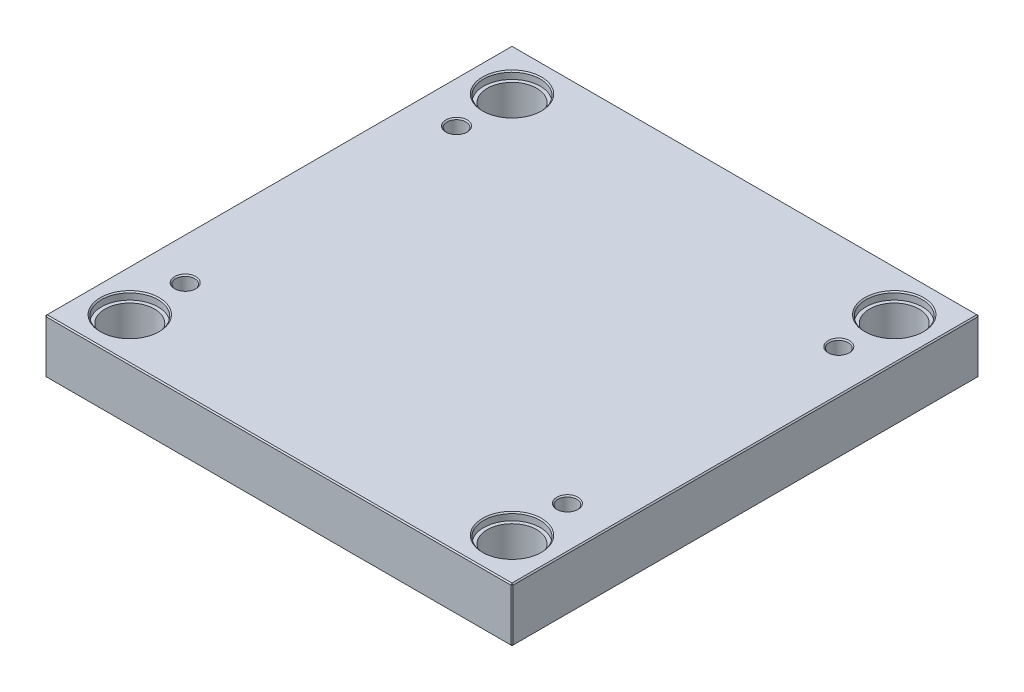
ISO-10303-21;
HEADER;
FILE_DESCRIPTION(('STEP AP214'),'2;1');
FILE_NAME('part.step','',(''),(''),'','','');
FILE_SCHEMA(('AUTOMOTIVE_DESIGN { 1 0 10303 214 1 1 1 1 }'));
ENDSEC;
DATA;
#1=APPLICATION_CONTEXT('core data for automotive mechanical design processes');
#2=APPLICATION_PROTOCOL_DEFINITION('international standard','automotive_design',2000,#1);
#3=PRODUCT_CONTEXT('',#1,'mechanical');
#4=PRODUCT('Part','Part','',(#3));
#5=PRODUCT_RELATED_PRODUCT_CATEGORY('part','',(#4));
#6=PRODUCT_DEFINITION_FORMATION('','',#4);
#7=PRODUCT_DEFINITION_CONTEXT('part definition',#1,'design');
#8=PRODUCT_DEFINITION('design','',#6,#7);
#9=PRODUCT_DEFINITION_SHAPE('','',#8);
#10=(LENGTH_UNIT() NAMED_UNIT(*) SI_UNIT(.MILLI.,.METRE.));
#11=(NAMED_UNIT(*) PLANE_ANGLE_UNIT() SI_UNIT($,.RADIAN.));
#12=(NAMED_UNIT(*) SI_UNIT($,.STERADIAN.) SOLID_ANGLE_UNIT());
#13=UNCERTAINTY_MEASURE_WITH_UNIT(LENGTH_MEASURE(1.E-05),#10,'distance_accuracy_value','');
#14=(GEOMETRIC_REPRESENTATION_CONTEXT(3) GLOBAL_UNCERTAINTY_ASSIGNED_CONTEXT((#13)) GLOBAL_UNIT_ASSIGNED_CONTEXT((#10,
#11,#12)) REPRESENTATION_CONTEXT('',''));
#15=CARTESIAN_POINT('',(0.,0.,0.));
#16=DIRECTION('',(0.,0.,1.));
#17=DIRECTION('',(1.,0.,0.));
#18=AXIS2_PLACEMENT_3D('',#15,#16,#17);
#19=CARTESIAN_POINT('',(-162.,0.,-162.));
#20=DIRECTION('',(0.,1.,0.));
#21=DIRECTION('',(0.,0.,1.));
#22=AXIS2_PLACEMENT_3D('',#19,#20,#21);
#23=CYLINDRICAL_SURFACE('',#22,21.);
#24=CARTESIAN_POINT('',(-162.,1.00000000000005,-162.));
#25=DIRECTION('',(0.,1.,0.));
#26=DIRECTION('',(0.,0.,1.));
#27=AXIS2_PLACEMENT_3D('',#24,#25,#26);
#28=CIRCLE('',#27,21.);
#29=CARTESIAN_POINT('',(-162.,1.00000000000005,-141.));
#30=VERTEX_POINT('',#29);
#31=EDGE_CURVE('E472',#30,#30,#28,.F.);
#32=ORIENTED_EDGE('',*,*,#31,.T.);
#33=EDGE_LOOP('',(#32));
#34=FACE_BOUND('',#33,.T.);
#35=CARTESIAN_POINT('',(-162.,39.7,-162.));
#36=DIRECTION('',(0.,1.,0.));
#37=DIRECTION('',(0.,0.,1.));
#38=AXIS2_PLACEMENT_3D('',#35,#36,#37);
#39=CIRCLE('',#38,21.);
#40=CARTESIAN_POINT('',(-162.,39.7,-141.));
#41=VERTEX_POINT('',#40);
#42=EDGE_CURVE('E221',#41,#41,#39,.F.);
#43=ORIENTED_EDGE('',*,*,#42,.F.);
#44=EDGE_LOOP('',(#43));
#45=FACE_BOUND('',#44,.T.);
#46=ADVANCED_FACE('F16',(#34,#45),#23,.F.);
#47=CARTESIAN_POINT('',(162.,0.,-162.));
#48=DIRECTION('',(0.,1.,0.));
#49=DIRECTION('',(0.,0.,1.));
#50=AXIS2_PLACEMENT_3D('',#47,#48,#49);
#51=CYLINDRICAL_SURFACE('',#50,21.);
#52=CARTESIAN_POINT('',(162.,1.00000000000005,-162.));
#53=DIRECTION('',(0.,1.,0.));
#54=DIRECTION('',(0.,0.,1.));
#55=AXIS2_PLACEMENT_3D('',#52,#53,#54);
#56=CIRCLE('',#55,21.);
#57=CARTESIAN_POINT('',(162.,1.00000000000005,-141.));
#58=VERTEX_POINT('',#57);
#59=EDGE_CURVE('E474',#58,#58,#56,.F.);
#60=ORIENTED_EDGE('',*,*,#59,.T.);
#61=EDGE_LOOP('',(#60));
#62=FACE_BOUND('',#61,.T.);
#63=CARTESIAN_POINT('',(162.,39.7,-162.));
#64=DIRECTION('',(0.,1.,0.));
#65=DIRECTION('',(0.,0.,1.));
#66=AXIS2_PLACEMENT_3D('',#63,#64,#65);
#67=CIRCLE('',#66,21.);
#68=CARTESIAN_POINT('',(162.,39.7,-141.));
#69=VERTEX_POINT('',#68);
#70=EDGE_CURVE('E218',#69,#69,#67,.F.);
#71=ORIENTED_EDGE('',*,*,#70,.F.);
#72=EDGE_LOOP('',(#71));
#73=FACE_BOUND('',#72,.T.);
#74=ADVANCED_FACE('F263',(#62,#73),#51,.F.);
#75=CARTESIAN_POINT('',(162.,0.,162.));
#76=DIRECTION('',(0.,1.,0.));
#77=DIRECTION('',(0.,0.,1.));
#78=AXIS2_PLACEMENT_3D('',#75,#76,#77);
#79=CYLINDRICAL_SURFACE('',#78,21.);
#80=CARTESIAN_POINT('',(162.,1.00000000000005,162.));
#81=DIRECTION('',(0.,1.,0.));
#82=DIRECTION('',(0.,0.,1.));
#83=AXIS2_PLACEMENT_3D('',#80,#81,#82);
#84=CIRCLE('',#83,21.);
#85=CARTESIAN_POINT('',(162.,1.00000000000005,183.));
#86=VERTEX_POINT('',#85);
#87=EDGE_CURVE('E477',#86,#86,#84,.F.);
#88=ORIENTED_EDGE('',*,*,#87,.T.);
#89=EDGE_LOOP('',(#88));
#90=FACE_BOUND('',#89,.T.);
#91=CARTESIAN_POINT('',(162.,39.7,162.));
#92=DIRECTION('',(0.,1.,0.));
#93=DIRECTION('',(0.,0.,1.));
#94=AXIS2_PLACEMENT_3D('',#91,#92,#93);
#95=CIRCLE('',#94,21.);
#96=CARTESIAN_POINT('',(162.,39.7,183.));
#97=VERTEX_POINT('',#96);
#98=EDGE_CURVE('E214',#97,#97,#95,.F.);
#99=ORIENTED_EDGE('',*,*,#98,.F.);
#100=EDGE_LOOP('',(#99));
#101=FACE_BOUND('',#100,.T.);
#102=ADVANCED_FACE('F270',(#90,#101),#79,.F.);
#103=CARTESIAN_POINT('',(-162.,0.,162.));
#104=DIRECTION('',(0.,1.,0.));
#105=DIRECTION('',(0.,0.,1.));
#106=AXIS2_PLACEMENT_3D('',#103,#104,#105);
#107=CYLINDRICAL_SURFACE('',#106,21.);
#108=CARTESIAN_POINT('',(-162.,1.00000000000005,162.));
#109=DIRECTION('',(0.,1.,0.));
#110=DIRECTION('',(0.,0.,1.));
#111=AXIS2_PLACEMENT_3D('',#108,#109,#110);
#112=CIRCLE('',#111,21.);
#113=CARTESIAN_POINT('',(-162.,1.00000000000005,183.));
#114=VERTEX_POINT('',#113);
#115=EDGE_CURVE('E480',#114,#114,#112,.F.);
#116=ORIENTED_EDGE('',*,*,#115,.T.);
#117=EDGE_LOOP('',(#116));
#118=FACE_BOUND('',#117,.T.);
#119=CARTESIAN_POINT('',(-162.,39.7,162.));
#120=DIRECTION('',(0.,1.,0.));
#121=DIRECTION('',(0.,0.,1.));
#122=AXIS2_PLACEMENT_3D('',#119,#120,#121);
#123=CIRCLE('',#122,21.);
#124=CARTESIAN_POINT('',(-162.,39.7,183.));
#125=VERTEX_POINT('',#124);
#126=EDGE_CURVE('E211',#125,#125,#123,.F.);
#127=ORIENTED_EDGE('',*,*,#126,.F.);
#128=EDGE_LOOP('',(#127));
#129=FACE_BOUND('',#128,.T.);
#130=ADVANCED_FACE('F277',(#118,#129),#107,.F.);
#131=CARTESIAN_POINT('',(-198.,46.,198.));
#132=DIRECTION('',(1.,0.,0.));
#133=DIRECTION('',(0.,0.,-1.));
#134=AXIS2_PLACEMENT_3D('',#131,#132,#133);
#135=PLANE('',#134);
#136=DIRECTION('',(0.,-1.,0.));
#137=VECTOR('',#136,1.);
#138=CARTESIAN_POINT('',(-198.,46.,-197.));
#139=LINE('',#138,#137);
#140=CARTESIAN_POINT('',(-198.,45.,-197.));
#141=VERTEX_POINT('',#140);
#142=CARTESIAN_POINT('',(-198.,1.,-197.));
#143=VERTEX_POINT('',#142);
#144=EDGE_CURVE('E487',#141,#143,#139,.T.);
#145=ORIENTED_EDGE('',*,*,#144,.T.);
#146=DIRECTION('',(0.,0.,1.));
#147=VECTOR('',#146,1.);
#148=CARTESIAN_POINT('',(-198.,1.,198.));
#149=LINE('',#148,#147);
#150=CARTESIAN_POINT('',(-198.,1.,197.));
#151=VERTEX_POINT('',#150);
#152=EDGE_CURVE('E490',#143,#151,#149,.T.);
#153=ORIENTED_EDGE('',*,*,#152,.T.);
#154=DIRECTION('',(0.,1.,0.));
#155=VECTOR('',#154,1.);
#156=CARTESIAN_POINT('',(-198.,46.,197.));
#157=LINE('',#156,#155);
#158=CARTESIAN_POINT('',(-198.,45.,197.));
#159=VERTEX_POINT('',#158);
#160=EDGE_CURVE('E485',#151,#159,#157,.T.);
#161=ORIENTED_EDGE('',*,*,#160,.T.);
#162=DIRECTION('',(0.,0.,-1.));
#163=VECTOR('',#162,1.);
#164=CARTESIAN_POINT('',(-198.,45.,-198.));
#165=LINE('',#164,#163);
#166=EDGE_CURVE('E483',#159,#141,#165,.T.);
#167=ORIENTED_EDGE('',*,*,#166,.T.);
#168=EDGE_LOOP('',(#145,#153,#161,#167));
#169=FACE_BOUND('',#168,.T.);
#170=ADVANCED_FACE('F298',(#169),#135,.F.);
#171=CARTESIAN_POINT('',(198.,46.,198.));
#172=DIRECTION('',(0.,0.,-1.));
#173=DIRECTION('',(-1.,0.,0.));
#174=AXIS2_PLACEMENT_3D('',#171,#172,#173);
#175=PLANE('',#174);
#176=DIRECTION('',(-1.,0.,0.));
#177=VECTOR('',#176,1.);
#178=CARTESIAN_POINT('',(-198.,45.,198.));
#179=LINE('',#178,#177);
#180=CARTESIAN_POINT('',(197.,45.,198.));
#181=VERTEX_POINT('',#180);
#182=CARTESIAN_POINT('',(-197.,45.,198.));
#183=VERTEX_POINT('',#182);
#184=EDGE_CURVE('E509',#181,#183,#179,.T.);
#185=ORIENTED_EDGE('',*,*,#184,.T.);
#186=DIRECTION('',(0.,-1.,0.));
#187=VECTOR('',#186,1.);
#188=CARTESIAN_POINT('',(-197.,46.,198.));
#189=LINE('',#188,#187);
#190=CARTESIAN_POINT('',(-197.,1.00000000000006,198.));
#191=VERTEX_POINT('',#190);
#192=EDGE_CURVE('E515',#183,#191,#189,.T.);
#193=ORIENTED_EDGE('',*,*,#192,.T.);
#194=DIRECTION('',(1.,0.,0.));
#195=VECTOR('',#194,1.);
#196=CARTESIAN_POINT('',(198.,1.00000000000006,198.));
#197=LINE('',#196,#195);
#198=CARTESIAN_POINT('',(197.,1.00000000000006,198.));
#199=VERTEX_POINT('',#198);
#200=EDGE_CURVE('E513',#191,#199,#197,.T.);
#201=ORIENTED_EDGE('',*,*,#200,.T.);
#202=DIRECTION('',(0.,1.,0.));
#203=VECTOR('',#202,1.);
#204=CARTESIAN_POINT('',(197.,46.,198.));
#205=LINE('',#204,#203);
#206=EDGE_CURVE('E511',#199,#181,#205,.T.);
#207=ORIENTED_EDGE('',*,*,#206,.T.);
#208=EDGE_LOOP('',(#185,#193,#201,#207));
#209=FACE_BOUND('',#208,.T.);
#210=ADVANCED_FACE('F294',(#209),#175,.F.);
#211=CARTESIAN_POINT('',(198.,46.,198.));
#212=DIRECTION('',(-1.,0.,0.));
#213=DIRECTION('',(0.,0.,1.));
#214=AXIS2_PLACEMENT_3D('',#211,#212,#213);
#215=PLANE('',#214);
#216=DIRECTION('',(0.,0.,-1.));
#217=VECTOR('',#216,1.);
#218=CARTESIAN_POINT('',(198.,1.00000000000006,198.));
#219=LINE('',#218,#217);
#220=CARTESIAN_POINT('',(198.,1.00000000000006,197.));
#221=VERTEX_POINT('',#220);
#222=CARTESIAN_POINT('',(198.,1.00000000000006,-197.));
#223=VERTEX_POINT('',#222);
#224=EDGE_CURVE('E504',#221,#223,#219,.T.);
#225=ORIENTED_EDGE('',*,*,#224,.T.);
#226=DIRECTION('',(0.,1.,0.));
#227=VECTOR('',#226,1.);
#228=CARTESIAN_POINT('',(198.,46.,-197.));
#229=LINE('',#228,#227);
#230=CARTESIAN_POINT('',(198.,45.,-197.));
#231=VERTEX_POINT('',#230);
#232=EDGE_CURVE('E506',#223,#231,#229,.T.);
#233=ORIENTED_EDGE('',*,*,#232,.T.);
#234=DIRECTION('',(0.,0.,1.));
#235=VECTOR('',#234,1.);
#236=CARTESIAN_POINT('',(198.,45.,198.));
#237=LINE('',#236,#235);
#238=CARTESIAN_POINT('',(198.,45.,197.));
#239=VERTEX_POINT('',#238);
#240=EDGE_CURVE('E500',#231,#239,#237,.T.);
#241=ORIENTED_EDGE('',*,*,#240,.T.);
#242=DIRECTION('',(0.,-1.,0.));
#243=VECTOR('',#242,1.);
#244=CARTESIAN_POINT('',(198.,46.,197.));
#245=LINE('',#244,#243);
#246=EDGE_CURVE('E502',#239,#221,#245,.T.);
#247=ORIENTED_EDGE('',*,*,#246,.T.);
#248=EDGE_LOOP('',(#225,#233,#241,#247));
#249=FACE_BOUND('',#248,.T.);
#250=ADVANCED_FACE('F290',(#249),#215,.F.);
#251=CARTESIAN_POINT('',(198.,46.,-198.));
#252=DIRECTION('',(0.,0.,1.));
#253=DIRECTION('',(1.,0.,0.));
#254=AXIS2_PLACEMENT_3D('',#251,#252,#253);
#255=PLANE('',#254);
#256=DIRECTION('',(0.,-1.,0.));
#257=VECTOR('',#256,1.);
#258=CARTESIAN_POINT('',(197.,46.,-198.));
#259=LINE('',#258,#257);
#260=CARTESIAN_POINT('',(197.,45.,-198.));
#261=VERTEX_POINT('',#260);
#262=CARTESIAN_POINT('',(197.,1.00000000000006,-198.));
#263=VERTEX_POINT('',#262);
#264=EDGE_CURVE('E494',#261,#263,#259,.T.);
#265=ORIENTED_EDGE('',*,*,#264,.T.);
#266=DIRECTION('',(-1.,0.,0.));
#267=VECTOR('',#266,1.);
#268=CARTESIAN_POINT('',(198.,1.00000000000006,-198.));
#269=LINE('',#268,#267);
#270=CARTESIAN_POINT('',(-197.,1.00000000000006,-198.));
#271=VERTEX_POINT('',#270);
#272=EDGE_CURVE('E138',#263,#271,#269,.T.);
#273=ORIENTED_EDGE('',*,*,#272,.T.);
#274=DIRECTION('',(0.,1.,0.));
#275=VECTOR('',#274,1.);
#276=CARTESIAN_POINT('',(-197.,46.,-198.));
#277=LINE('',#276,#275);
#278=CARTESIAN_POINT('',(-197.,45.,-198.));
#279=VERTEX_POINT('',#278);
#280=EDGE_CURVE('E496',#271,#279,#277,.T.);
#281=ORIENTED_EDGE('',*,*,#280,.T.);
#282=DIRECTION('',(1.,0.,0.));
#283=VECTOR('',#282,1.);
#284=CARTESIAN_POINT('',(198.,45.,-198.));
#285=LINE('',#284,#283);
#286=EDGE_CURVE('E492',#279,#261,#285,.T.);
#287=ORIENTED_EDGE('',*,*,#286,.T.);
#288=EDGE_LOOP('',(#265,#273,#281,#287));
#289=FACE_BOUND('',#288,.T.);
#290=ADVANCED_FACE('F282',(#289),#255,.F.);
#291=CARTESIAN_POINT('',(0.,46.,0.));
#292=DIRECTION('',(0.,1.,0.));
#293=DIRECTION('',(0.,0.,1.));
#294=AXIS2_PLACEMENT_3D('',#291,#292,#293);
#295=PLANE('',#294);
#296=CARTESIAN_POINT('',(162.,46.,162.));
#297=DIRECTION('',(0.,1.,0.));
#298=DIRECTION('',(0.,0.,1.));
#299=AXIS2_PLACEMENT_3D('',#296,#297,#298);
#300=CIRCLE('',#299,25.);
#301=CARTESIAN_POINT('',(162.,46.,187.));
#302=VERTEX_POINT('',#301);
#303=EDGE_CURVE('E236',#302,#302,#300,.F.);
#304=ORIENTED_EDGE('',*,*,#303,.T.);
#305=EDGE_LOOP('',(#304));
#306=FACE_BOUND('',#305,.T.);
#307=CARTESIAN_POINT('',(-162.,46.,162.));
#308=DIRECTION('',(0.,1.,0.));
#309=DIRECTION('',(0.,0.,1.));
#310=AXIS2_PLACEMENT_3D('',#307,#308,#309);
#311=CIRCLE('',#310,25.);
#312=CARTESIAN_POINT('',(-162.,46.,187.));
#313=VERTEX_POINT('',#312);
#314=EDGE_CURVE('E233',#313,#313,#311,.F.);
#315=ORIENTED_EDGE('',*,*,#314,.T.);
#316=EDGE_LOOP('',(#315));
#317=FACE_BOUND('',#316,.T.);
#318=CARTESIAN_POINT('',(162.,46.,-162.));
#319=DIRECTION('',(0.,1.,0.));
#320=DIRECTION('',(0.,0.,1.));
#321=AXIS2_PLACEMENT_3D('',#318,#319,#320);
#322=CIRCLE('',#321,25.);
#323=CARTESIAN_POINT('',(162.,46.,-137.));
#324=VERTEX_POINT('',#323);
#325=EDGE_CURVE('E230',#324,#324,#322,.F.);
#326=ORIENTED_EDGE('',*,*,#325,.T.);
#327=EDGE_LOOP('',(#326));
#328=FACE_BOUND('',#327,.T.);
#329=CARTESIAN_POINT('',(-162.,46.,-162.));
#330=DIRECTION('',(0.,1.,0.));
#331=DIRECTION('',(0.,0.,1.));
#332=AXIS2_PLACEMENT_3D('',#329,#330,#331);
#333=CIRCLE('',#332,25.);
#334=CARTESIAN_POINT('',(-162.,46.,-137.));
#335=VERTEX_POINT('',#334);
#336=EDGE_CURVE('E227',#335,#335,#333,.F.);
#337=ORIENTED_EDGE('',*,*,#336,.T.);
#338=EDGE_LOOP('',(#337));
#339=FACE_BOUND('',#338,.T.);
#340=CARTESIAN_POINT('',(-162.,46.,115.));
#341=DIRECTION('',(0.,1.,0.));
#342=DIRECTION('',(0.,0.,1.));
#343=AXIS2_PLACEMENT_3D('',#340,#341,#342);
#344=CIRCLE('',#343,9.00000000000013);
#345=CARTESIAN_POINT('',(-162.,46.,124.));
#346=VERTEX_POINT('',#345);
#347=EDGE_CURVE('E198',#346,#346,#344,.F.);
#348=ORIENTED_EDGE('',*,*,#347,.T.);
#349=EDGE_LOOP('',(#348));
#350=FACE_BOUND('',#349,.T.);
#351=CARTESIAN_POINT('',(162.,46.,115.));
#352=DIRECTION('',(0.,1.,0.));
#353=DIRECTION('',(0.,0.,1.));
#354=AXIS2_PLACEMENT_3D('',#351,#352,#353);
#355=CIRCLE('',#354,9.00000000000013);
#356=CARTESIAN_POINT('',(162.,46.,124.));
#357=VERTEX_POINT('',#356);
#358=EDGE_CURVE('E195',#357,#357,#355,.F.);
#359=ORIENTED_EDGE('',*,*,#358,.T.);
#360=EDGE_LOOP('',(#359));
#361=FACE_BOUND('',#360,.T.);
#362=CARTESIAN_POINT('',(162.,46.,-115.));
#363=DIRECTION('',(0.,1.,0.));
#364=DIRECTION('',(0.,0.,1.));
#365=AXIS2_PLACEMENT_3D('',#362,#363,#364);
#366=CIRCLE('',#365,9.00000000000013);
#367=CARTESIAN_POINT('',(162.,46.,-106.));
#368=VERTEX_POINT('',#367);
#369=EDGE_CURVE('E192',#368,#368,#366,.F.);
#370=ORIENTED_EDGE('',*,*,#369,.T.);
#371=EDGE_LOOP('',(#370));
#372=FACE_BOUND('',#371,.T.);
#373=CARTESIAN_POINT('',(-162.,46.,-115.));
#374=DIRECTION('',(0.,1.,0.));
#375=DIRECTION('',(0.,0.,1.));
#376=AXIS2_PLACEMENT_3D('',#373,#374,#375);
#377=CIRCLE('',#376,9.00000000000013);
#378=CARTESIAN_POINT('',(-162.,46.,-106.));
#379=VERTEX_POINT('',#378);
#380=EDGE_CURVE('E188',#379,#379,#377,.F.);
#381=ORIENTED_EDGE('',*,*,#380,.T.);
#382=EDGE_LOOP('',(#381));
#383=FACE_BOUND('',#382,.T.);
#384=DIRECTION('',(0.,0.,-1.));
#385=VECTOR('',#384,1.);
#386=CARTESIAN_POINT('',(197.,46.,-198.));
#387=LINE('',#386,#385);
#388=CARTESIAN_POINT('',(197.,46.,197.));
#389=VERTEX_POINT('',#388);
#390=CARTESIAN_POINT('',(197.,46.,-197.));
#391=VERTEX_POINT('',#390);
#392=EDGE_CURVE('E31',#389,#391,#387,.T.);
#393=ORIENTED_EDGE('',*,*,#392,.T.);
#394=DIRECTION('',(-1.,0.,0.));
#395=VECTOR('',#394,1.);
#396=CARTESIAN_POINT('',(-198.,46.,-197.));
#397=LINE('',#396,#395);
#398=CARTESIAN_POINT('',(-197.,46.,-197.));
#399=VERTEX_POINT('',#398);
#400=EDGE_CURVE('E189',#391,#399,#397,.T.);
#401=ORIENTED_EDGE('',*,*,#400,.T.);
#402=DIRECTION('',(0.,0.,1.));
#403=VECTOR('',#402,1.);
#404=CARTESIAN_POINT('',(-197.,46.,198.));
#405=LINE('',#404,#403);
#406=CARTESIAN_POINT('',(-197.,46.,197.));
#407=VERTEX_POINT('',#406);
#408=EDGE_CURVE('E518',#399,#407,#405,.T.);
#409=ORIENTED_EDGE('',*,*,#408,.T.);
#410=DIRECTION('',(1.,0.,0.));
#411=VECTOR('',#410,1.);
#412=CARTESIAN_POINT('',(198.,46.,197.));
#413=LINE('',#412,#411);
#414=EDGE_CURVE('E36',#407,#389,#413,.T.);
#415=ORIENTED_EDGE('',*,*,#414,.T.);
#416=EDGE_LOOP('',(#393,#401,#409,#415));
#417=FACE_BOUND('',#416,.T.);
#418=ADVANCED_FACE('F279',(#306,#317,#328,#339,#350,#361,#372,#383,#417),#295,.T.);
#419=CARTESIAN_POINT('',(0.,0.,0.));
#420=DIRECTION('',(0.,1.,0.));
#421=DIRECTION('',(0.,0.,1.));
#422=AXIS2_PLACEMENT_3D('',#419,#420,#421);
#423=PLANE('',#422);
#424=CARTESIAN_POINT('',(-162.,0.,-162.));
#425=DIRECTION('',(0.,1.,0.));
#426=DIRECTION('',(0.,0.,1.));
#427=AXIS2_PLACEMENT_3D('',#424,#425,#426);
#428=CIRCLE('',#427,22.);
#429=CARTESIAN_POINT('',(-162.,0.,-140.));
#430=VERTEX_POINT('',#429);
#431=EDGE_CURVE('E469',#430,#430,#428,.T.);
#432=ORIENTED_EDGE('',*,*,#431,.T.);
#433=EDGE_LOOP('',(#432));
#434=FACE_BOUND('',#433,.T.);
#435=CARTESIAN_POINT('',(162.,0.,-162.));
#436=DIRECTION('',(0.,1.,0.));
#437=DIRECTION('',(0.,0.,1.));
#438=AXIS2_PLACEMENT_3D('',#435,#436,#437);
#439=CIRCLE('',#438,22.);
#440=CARTESIAN_POINT('',(162.,0.,-140.));
#441=VERTEX_POINT('',#440);
#442=EDGE_CURVE('E466',#441,#441,#439,.T.);
#443=ORIENTED_EDGE('',*,*,#442,.T.);
#444=EDGE_LOOP('',(#443));
#445=FACE_BOUND('',#444,.T.);
#446=CARTESIAN_POINT('',(162.,0.,162.));
#447=DIRECTION('',(0.,1.,0.));
#448=DIRECTION('',(0.,0.,1.));
#449=AXIS2_PLACEMENT_3D('',#446,#447,#448);
#450=CIRCLE('',#449,22.);
#451=CARTESIAN_POINT('',(162.,0.,184.));
#452=VERTEX_POINT('',#451);
#453=EDGE_CURVE('E463',#452,#452,#450,.T.);
#454=ORIENTED_EDGE('',*,*,#453,.T.);
#455=EDGE_LOOP('',(#454));
#456=FACE_BOUND('',#455,.T.);
#457=CARTESIAN_POINT('',(-162.,0.,162.));
#458=DIRECTION('',(0.,1.,0.));
#459=DIRECTION('',(0.,0.,1.));
#460=AXIS2_PLACEMENT_3D('',#457,#458,#459);
#461=CIRCLE('',#460,22.);
#462=CARTESIAN_POINT('',(-162.,0.,184.));
#463=VERTEX_POINT('',#462);
#464=EDGE_CURVE('E460',#463,#463,#461,.T.);
#465=ORIENTED_EDGE('',*,*,#464,.T.);
#466=EDGE_LOOP('',(#465));
#467=FACE_BOUND('',#466,.T.);
#468=DIRECTION('',(0.,0.,1.));
#469=VECTOR('',#468,1.);
#470=CARTESIAN_POINT('',(197.,0.,0.));
#471=LINE('',#470,#469);
#472=CARTESIAN_POINT('',(197.,0.,-197.));
#473=VERTEX_POINT('',#472);
#474=CARTESIAN_POINT('',(197.,0.,197.));
#475=VERTEX_POINT('',#474);
#476=EDGE_CURVE('E108',#473,#475,#471,.T.);
#477=ORIENTED_EDGE('',*,*,#476,.T.);
#478=DIRECTION('',(-1.,0.,0.));
#479=VECTOR('',#478,1.);
#480=CARTESIAN_POINT('',(0.,0.,197.));
#481=LINE('',#480,#479);
#482=CARTESIAN_POINT('',(-197.,0.,197.));
#483=VERTEX_POINT('',#482);
#484=EDGE_CURVE('E458',#475,#483,#481,.T.);
#485=ORIENTED_EDGE('',*,*,#484,.T.);
#486=DIRECTION('',(0.,0.,-1.));
#487=VECTOR('',#486,1.);
#488=CARTESIAN_POINT('',(-197.,0.,0.));
#489=LINE('',#488,#487);
#490=CARTESIAN_POINT('',(-197.,0.,-197.));
#491=VERTEX_POINT('',#490);
#492=EDGE_CURVE('E110',#483,#491,#489,.T.);
#493=ORIENTED_EDGE('',*,*,#492,.T.);
#494=DIRECTION('',(1.,0.,0.));
#495=VECTOR('',#494,1.);
#496=CARTESIAN_POINT('',(0.,0.,-197.));
#497=LINE('',#496,#495);
#498=EDGE_CURVE('E104',#491,#473,#497,.T.);
#499=ORIENTED_EDGE('',*,*,#498,.T.);
#500=EDGE_LOOP('',(#477,#485,#493,#499));
#501=FACE_BOUND('',#500,.T.);
#502=ADVANCED_FACE('F106',(#434,#445,#456,#467,#501),#423,.F.);
#503=CARTESIAN_POINT('',(-162.,0.,-162.));
#504=DIRECTION('',(0.,-1.,0.));
#505=DIRECTION('',(0.,0.,-1.));
#506=AXIS2_PLACEMENT_3D('',#503,#504,#505);
#507=CONICAL_SURFACE('',#506,22.,0.785398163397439);
#508=ORIENTED_EDGE('',*,*,#31,.F.);
#509=EDGE_LOOP('',(#508));
#510=FACE_BOUND('',#509,.T.);
#511=ORIENTED_EDGE('',*,*,#431,.F.);
#512=EDGE_LOOP('',(#511));
#513=FACE_BOUND('',#512,.T.);
#514=ADVANCED_FACE('F286',(#510,#513),#507,.F.);
#515=CARTESIAN_POINT('',(162.,0.,-162.));
#516=DIRECTION('',(0.,-1.,0.));
#517=DIRECTION('',(0.,0.,-1.));
#518=AXIS2_PLACEMENT_3D('',#515,#516,#517);
#519=CONICAL_SURFACE('',#518,22.,0.785398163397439);
#520=ORIENTED_EDGE('',*,*,#59,.F.);
#521=EDGE_LOOP('',(#520));
#522=FACE_BOUND('',#521,.T.);
#523=ORIENTED_EDGE('',*,*,#442,.F.);
#524=EDGE_LOOP('',(#523));
#525=FACE_BOUND('',#524,.T.);
#526=ADVANCED_FACE('F305',(#522,#525),#519,.F.);
#527=CARTESIAN_POINT('',(162.,0.,162.));
#528=DIRECTION('',(0.,-1.,0.));
#529=DIRECTION('',(0.,0.,-1.));
#530=AXIS2_PLACEMENT_3D('',#527,#528,#529);
#531=CONICAL_SURFACE('',#530,22.,0.785398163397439);
#532=ORIENTED_EDGE('',*,*,#87,.F.);
#533=EDGE_LOOP('',(#532));
#534=FACE_BOUND('',#533,.T.);
#535=ORIENTED_EDGE('',*,*,#453,.F.);
#536=EDGE_LOOP('',(#535));
#537=FACE_BOUND('',#536,.T.);
#538=ADVANCED_FACE('F309',(#534,#537),#531,.F.);
#539=CARTESIAN_POINT('',(-162.,0.,162.));
#540=DIRECTION('',(0.,-1.,0.));
#541=DIRECTION('',(0.,0.,-1.));
#542=AXIS2_PLACEMENT_3D('',#539,#540,#541);
#543=CONICAL_SURFACE('',#542,22.,0.785398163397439);
#544=ORIENTED_EDGE('',*,*,#115,.F.);
#545=EDGE_LOOP('',(#544));
#546=FACE_BOUND('',#545,.T.);
#547=ORIENTED_EDGE('',*,*,#464,.F.);
#548=EDGE_LOOP('',(#547));
#549=FACE_BOUND('',#548,.T.);
#550=ADVANCED_FACE('F313',(#546,#549),#543,.F.);
#551=CARTESIAN_POINT('',(198.,46.,197.));
#552=DIRECTION('',(-0.707106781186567,0.,-0.707106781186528));
#553=DIRECTION('',(0.,-1.,0.));
#554=AXIS2_PLACEMENT_3D('',#551,#552,#553);
#555=PLANE('',#554);
#556=DIRECTION('',(-0.707106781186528,0.,0.707106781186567));
#557=VECTOR('',#556,1.);
#558=CARTESIAN_POINT('',(197.,45.,198.));
#559=LINE('',#558,#557);
#560=EDGE_CURVE('E126',#181,#239,#559,.F.);
#561=ORIENTED_EDGE('',*,*,#560,.F.);
#562=ORIENTED_EDGE('',*,*,#206,.F.);
#563=DIRECTION('',(0.707106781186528,0.,-0.707106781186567));
#564=VECTOR('',#563,1.);
#565=CARTESIAN_POINT('',(197.,1.00000000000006,198.));
#566=LINE('',#565,#564);
#567=EDGE_CURVE('E180',#221,#199,#566,.F.);
#568=ORIENTED_EDGE('',*,*,#567,.F.);
#569=ORIENTED_EDGE('',*,*,#246,.F.);
#570=EDGE_LOOP('',(#561,#562,#568,#569));
#571=FACE_BOUND('',#570,.T.);
#572=ADVANCED_FACE('F317',(#571),#555,.F.);
#573=CARTESIAN_POINT('',(197.,45.,198.));
#574=DIRECTION('',(0.577350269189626,0.577350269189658,0.577350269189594));
#575=DIRECTION('',(-0.707106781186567,0.707106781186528,0.));
#576=AXIS2_PLACEMENT_3D('',#573,#574,#575);
#577=PLANE('',#576);
#578=DIRECTION('',(0.,-0.707106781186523,0.707106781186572));
#579=VECTOR('',#578,1.);
#580=CARTESIAN_POINT('',(197.,45.,198.));
#581=LINE('',#580,#579);
#582=EDGE_CURVE('E175',#181,#389,#581,.F.);
#583=ORIENTED_EDGE('',*,*,#582,.F.);
#584=ORIENTED_EDGE('',*,*,#560,.T.);
#585=DIRECTION('',(-0.707106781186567,0.707106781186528,0.));
#586=VECTOR('',#585,1.);
#587=CARTESIAN_POINT('',(197.5,45.5,197.));
#588=LINE('',#587,#586);
#589=EDGE_CURVE('E177',#389,#239,#588,.F.);
#590=ORIENTED_EDGE('',*,*,#589,.F.);
#591=EDGE_LOOP('',(#583,#584,#590));
#592=FACE_BOUND('',#591,.T.);
#593=ADVANCED_FACE('F385',(#592),#577,.T.);
#594=CARTESIAN_POINT('',(197.,1.00000000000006,198.));
#595=DIRECTION('',(0.577350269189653,-0.577350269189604,0.57735026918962));
#596=DIRECTION('',(0.707106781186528,0.,-0.707106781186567));
#597=AXIS2_PLACEMENT_3D('',#594,#595,#596);
#598=PLANE('',#597);
#599=DIRECTION('',(-0.707106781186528,-0.707106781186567,0.));
#600=VECTOR('',#599,1.);
#601=CARTESIAN_POINT('',(197.5,0.500000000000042,197.));
#602=LINE('',#601,#600);
#603=EDGE_CURVE('E124',#221,#475,#602,.T.);
#604=ORIENTED_EDGE('',*,*,#603,.F.);
#605=ORIENTED_EDGE('',*,*,#567,.T.);
#606=DIRECTION('',(0.,0.707106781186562,0.707106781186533));
#607=VECTOR('',#606,1.);
#608=CARTESIAN_POINT('',(197.,1.00000000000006,198.));
#609=LINE('',#608,#607);
#610=EDGE_CURVE('E172',#475,#199,#609,.T.);
#611=ORIENTED_EDGE('',*,*,#610,.F.);
#612=EDGE_LOOP('',(#604,#605,#611));
#613=FACE_BOUND('',#612,.T.);
#614=ADVANCED_FACE('F381',(#613),#598,.T.);
#615=CARTESIAN_POINT('',(197.,46.,0.));
#616=DIRECTION('',(0.707106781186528,0.707106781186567,0.));
#617=DIRECTION('',(0.,0.,1.));
#618=AXIS2_PLACEMENT_3D('',#615,#616,#617);
#619=PLANE('',#618);
#620=ORIENTED_EDGE('',*,*,#589,.T.);
#621=ORIENTED_EDGE('',*,*,#240,.F.);
#622=DIRECTION('',(0.707106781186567,-0.707106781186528,0.));
#623=VECTOR('',#622,1.);
#624=CARTESIAN_POINT('',(198.,45.,-197.));
#625=LINE('',#624,#623);
#626=EDGE_CURVE('E166',#391,#231,#625,.T.);
#627=ORIENTED_EDGE('',*,*,#626,.F.);
#628=ORIENTED_EDGE('',*,*,#392,.F.);
#629=EDGE_LOOP('',(#620,#621,#627,#628));
#630=FACE_BOUND('',#629,.T.);
#631=ADVANCED_FACE('F377',(#630),#619,.T.);
#632=CARTESIAN_POINT('',(0.,46.,197.));
#633=DIRECTION('',(0.,0.707106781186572,0.707106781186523));
#634=DIRECTION('',(-1.,0.,0.));
#635=AXIS2_PLACEMENT_3D('',#632,#633,#634);
#636=PLANE('',#635);
#637=ORIENTED_EDGE('',*,*,#582,.T.);
#638=ORIENTED_EDGE('',*,*,#414,.F.);
#639=DIRECTION('',(0.,0.707106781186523,-0.707106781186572));
#640=VECTOR('',#639,1.);
#641=CARTESIAN_POINT('',(-197.,45.5,197.5));
#642=LINE('',#641,#640);
#643=EDGE_CURVE('E163',#183,#407,#642,.T.);
#644=ORIENTED_EDGE('',*,*,#643,.F.);
#645=ORIENTED_EDGE('',*,*,#184,.F.);
#646=EDGE_LOOP('',(#637,#638,#644,#645));
#647=FACE_BOUND('',#646,.T.);
#648=ADVANCED_FACE('F373',(#647),#636,.T.);
#649=CARTESIAN_POINT('',(-197.,46.,198.));
#650=DIRECTION('',(0.707106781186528,0.,-0.707106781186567));
#651=DIRECTION('',(0.,-1.,0.));
#652=AXIS2_PLACEMENT_3D('',#649,#650,#651);
#653=PLANE('',#652);
#654=DIRECTION('',(0.707106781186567,0.,0.707106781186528));
#655=VECTOR('',#654,1.);
#656=CARTESIAN_POINT('',(-197.,1.00000000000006,198.));
#657=LINE('',#656,#655);
#658=EDGE_CURVE('E157',#191,#151,#657,.F.);
#659=ORIENTED_EDGE('',*,*,#658,.F.);
#660=ORIENTED_EDGE('',*,*,#192,.F.);
#661=DIRECTION('',(-0.707106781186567,0.,-0.707106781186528));
#662=VECTOR('',#661,1.);
#663=CARTESIAN_POINT('',(-198.,45.,197.));
#664=LINE('',#663,#662);
#665=EDGE_CURVE('E160',#159,#183,#664,.F.);
#666=ORIENTED_EDGE('',*,*,#665,.F.);
#667=ORIENTED_EDGE('',*,*,#160,.F.);
#668=EDGE_LOOP('',(#659,#660,#666,#667));
#669=FACE_BOUND('',#668,.T.);
#670=ADVANCED_FACE('F369',(#669),#653,.F.);
#671=CARTESIAN_POINT('',(198.,1.00000000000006,198.));
#672=DIRECTION('',(0.,0.707106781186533,-0.707106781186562));
#673=DIRECTION('',(1.,0.,0.));
#674=AXIS2_PLACEMENT_3D('',#671,#672,#673);
#675=PLANE('',#674);
#676=ORIENTED_EDGE('',*,*,#610,.T.);
#677=ORIENTED_EDGE('',*,*,#200,.F.);
#678=DIRECTION('',(0.,-0.707106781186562,-0.707106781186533));
#679=VECTOR('',#678,1.);
#680=CARTESIAN_POINT('',(-197.,1.00000000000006,198.));
#681=LINE('',#680,#679);
#682=EDGE_CURVE('E135',#483,#191,#681,.F.);
#683=ORIENTED_EDGE('',*,*,#682,.F.);
#684=ORIENTED_EDGE('',*,*,#484,.F.);
#685=EDGE_LOOP('',(#676,#677,#683,#684));
#686=FACE_BOUND('',#685,.T.);
#687=ADVANCED_FACE('F366',(#686),#675,.F.);
#688=CARTESIAN_POINT('',(198.,1.00000000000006,198.));
#689=DIRECTION('',(-0.707106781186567,0.707106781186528,0.));
#690=DIRECTION('',(0.,0.,-1.));
#691=AXIS2_PLACEMENT_3D('',#688,#689,#690);
#692=PLANE('',#691);
#693=ORIENTED_EDGE('',*,*,#603,.T.);
#694=ORIENTED_EDGE('',*,*,#476,.F.);
#695=DIRECTION('',(0.707106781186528,0.707106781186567,0.));
#696=VECTOR('',#695,1.);
#697=CARTESIAN_POINT('',(197.5,0.500000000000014,-197.));
#698=LINE('',#697,#696);
#699=EDGE_CURVE('E121',#223,#473,#698,.F.);
#700=ORIENTED_EDGE('',*,*,#699,.F.);
#701=ORIENTED_EDGE('',*,*,#224,.F.);
#702=EDGE_LOOP('',(#693,#694,#700,#701));
#703=FACE_BOUND('',#702,.T.);
#704=ADVANCED_FACE('F119',(#703),#692,.F.);
#705=CARTESIAN_POINT('',(197.,46.,-198.));
#706=DIRECTION('',(-0.707106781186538,0.,0.707106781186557));
#707=DIRECTION('',(0.,-1.,0.));
#708=AXIS2_PLACEMENT_3D('',#705,#706,#707);
#709=PLANE('',#708);
#710=DIRECTION('',(0.707106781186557,0.,0.707106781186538));
#711=VECTOR('',#710,1.);
#712=CARTESIAN_POINT('',(198.,45.,-197.));
#713=LINE('',#712,#711);
#714=EDGE_CURVE('E168',#231,#261,#713,.F.);
#715=ORIENTED_EDGE('',*,*,#714,.F.);
#716=ORIENTED_EDGE('',*,*,#232,.F.);
#717=DIRECTION('',(-0.707106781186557,0.,-0.707106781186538));
#718=VECTOR('',#717,1.);
#719=CARTESIAN_POINT('',(197.,1.00000000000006,-198.));
#720=LINE('',#719,#718);
#721=EDGE_CURVE('E134',#263,#223,#720,.F.);
#722=ORIENTED_EDGE('',*,*,#721,.F.);
#723=ORIENTED_EDGE('',*,*,#264,.F.);
#724=EDGE_LOOP('',(#715,#716,#722,#723));
#725=FACE_BOUND('',#724,.T.);
#726=ADVANCED_FACE('F359',(#725),#709,.F.);
#727=CARTESIAN_POINT('',(198.,45.,-197.));
#728=DIRECTION('',(0.577350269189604,0.577350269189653,-0.57735026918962));
#729=DIRECTION('',(0.,0.707106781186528,0.707106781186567));
#730=AXIS2_PLACEMENT_3D('',#727,#728,#729);
#731=PLANE('',#730);
#732=ORIENTED_EDGE('',*,*,#626,.T.);
#733=ORIENTED_EDGE('',*,*,#714,.T.);
#734=DIRECTION('',(0.,0.707106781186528,0.707106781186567));
#735=VECTOR('',#734,1.);
#736=CARTESIAN_POINT('',(197.,45.5,-197.5));
#737=LINE('',#736,#735);
#738=EDGE_CURVE('E152',#391,#261,#737,.F.);
#739=ORIENTED_EDGE('',*,*,#738,.F.);
#740=EDGE_LOOP('',(#732,#733,#739));
#741=FACE_BOUND('',#740,.T.);
#742=ADVANCED_FACE('F355',(#741),#731,.T.);
#743=CARTESIAN_POINT('',(-198.,45.,197.));
#744=DIRECTION('',(-0.577350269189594,0.577350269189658,0.577350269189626));
#745=DIRECTION('',(0.,-0.707106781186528,0.707106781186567));
#746=AXIS2_PLACEMENT_3D('',#743,#744,#745);
#747=PLANE('',#746);
#748=ORIENTED_EDGE('',*,*,#665,.T.);
#749=ORIENTED_EDGE('',*,*,#643,.T.);
#750=DIRECTION('',(-0.707106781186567,-0.707106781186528,0.));
#751=VECTOR('',#750,1.);
#752=CARTESIAN_POINT('',(-198.,45.,197.));
#753=LINE('',#752,#751);
#754=EDGE_CURVE('E143',#159,#407,#753,.F.);
#755=ORIENTED_EDGE('',*,*,#754,.F.);
#756=EDGE_LOOP('',(#748,#749,#755));
#757=FACE_BOUND('',#756,.T.);
#758=ADVANCED_FACE('F351',(#757),#747,.T.);
#759=CARTESIAN_POINT('',(-197.,1.00000000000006,198.));
#760=DIRECTION('',(-0.577350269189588,-0.577350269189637,0.577350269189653));
#761=DIRECTION('',(0.,-0.707106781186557,-0.707106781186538));
#762=AXIS2_PLACEMENT_3D('',#759,#760,#761);
#763=PLANE('',#762);
#764=ORIENTED_EDGE('',*,*,#682,.T.);
#765=ORIENTED_EDGE('',*,*,#658,.T.);
#766=DIRECTION('',(-0.707106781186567,0.707106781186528,0.));
#767=VECTOR('',#766,1.);
#768=CARTESIAN_POINT('',(-197.5,0.500000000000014,197.));
#769=LINE('',#768,#767);
#770=EDGE_CURVE('E139',#483,#151,#769,.T.);
#771=ORIENTED_EDGE('',*,*,#770,.F.);
#772=EDGE_LOOP('',(#764,#765,#771));
#773=FACE_BOUND('',#772,.T.);
#774=ADVANCED_FACE('F348',(#773),#763,.T.);
#775=CARTESIAN_POINT('',(197.,1.00000000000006,-198.));
#776=DIRECTION('',(0.577350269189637,-0.577350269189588,-0.577350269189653));
#777=DIRECTION('',(-0.707106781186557,0.,-0.707106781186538));
#778=AXIS2_PLACEMENT_3D('',#775,#776,#777);
#779=PLANE('',#778);
#780=ORIENTED_EDGE('',*,*,#721,.T.);
#781=ORIENTED_EDGE('',*,*,#699,.T.);
#782=DIRECTION('',(0.,-0.707106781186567,0.707106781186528));
#783=VECTOR('',#782,1.);
#784=CARTESIAN_POINT('',(197.,1.00000000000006,-198.));
#785=LINE('',#784,#783);
#786=EDGE_CURVE('E131',#263,#473,#785,.T.);
#787=ORIENTED_EDGE('',*,*,#786,.F.);
#788=EDGE_LOOP('',(#780,#781,#787));
#789=FACE_BOUND('',#788,.T.);
#790=ADVANCED_FACE('F130',(#789),#779,.T.);
#791=CARTESIAN_POINT('',(0.,46.,-197.));
#792=DIRECTION('',(0.,0.707106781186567,-0.707106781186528));
#793=DIRECTION('',(1.,0.,0.));
#794=AXIS2_PLACEMENT_3D('',#791,#792,#793);
#795=PLANE('',#794);
#796=ORIENTED_EDGE('',*,*,#738,.T.);
#797=ORIENTED_EDGE('',*,*,#286,.F.);
#798=DIRECTION('',(0.,-0.707106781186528,-0.707106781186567));
#799=VECTOR('',#798,1.);
#800=CARTESIAN_POINT('',(-197.,45.,-198.));
#801=LINE('',#800,#799);
#802=EDGE_CURVE('E140',#399,#279,#801,.T.);
#803=ORIENTED_EDGE('',*,*,#802,.F.);
#804=ORIENTED_EDGE('',*,*,#400,.F.);
#805=EDGE_LOOP('',(#796,#797,#803,#804));
#806=FACE_BOUND('',#805,.T.);
#807=ADVANCED_FACE('F341',(#806),#795,.T.);
#808=CARTESIAN_POINT('',(-197.,46.,0.));
#809=DIRECTION('',(-0.707106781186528,0.707106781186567,0.));
#810=DIRECTION('',(0.,0.,-1.));
#811=AXIS2_PLACEMENT_3D('',#808,#809,#810);
#812=PLANE('',#811);
#813=ORIENTED_EDGE('',*,*,#754,.T.);
#814=ORIENTED_EDGE('',*,*,#408,.F.);
#815=DIRECTION('',(0.707106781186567,0.707106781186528,0.));
#816=VECTOR('',#815,1.);
#817=CARTESIAN_POINT('',(-197.5,45.5,-197.));
#818=LINE('',#817,#816);
#819=EDGE_CURVE('E146',#141,#399,#818,.T.);
#820=ORIENTED_EDGE('',*,*,#819,.F.);
#821=ORIENTED_EDGE('',*,*,#166,.F.);
#822=EDGE_LOOP('',(#813,#814,#820,#821));
#823=FACE_BOUND('',#822,.T.);
#824=ADVANCED_FACE('F337',(#823),#812,.T.);
#825=CARTESIAN_POINT('',(-198.,1.,198.));
#826=DIRECTION('',(0.707106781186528,0.707106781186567,0.));
#827=DIRECTION('',(0.,0.,1.));
#828=AXIS2_PLACEMENT_3D('',#825,#826,#827);
#829=PLANE('',#828);
#830=ORIENTED_EDGE('',*,*,#770,.T.);
#831=ORIENTED_EDGE('',*,*,#152,.F.);
#832=DIRECTION('',(0.707106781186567,-0.707106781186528,0.));
#833=VECTOR('',#832,1.);
#834=CARTESIAN_POINT('',(-198.,1.,-197.));
#835=LINE('',#834,#833);
#836=EDGE_CURVE('E529',#491,#143,#835,.F.);
#837=ORIENTED_EDGE('',*,*,#836,.F.);
#838=ORIENTED_EDGE('',*,*,#492,.F.);
#839=EDGE_LOOP('',(#830,#831,#837,#838));
#840=FACE_BOUND('',#839,.T.);
#841=ADVANCED_FACE('F334',(#840),#829,.F.);
#842=CARTESIAN_POINT('',(198.,1.00000000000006,-198.));
#843=DIRECTION('',(0.,0.707106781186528,0.707106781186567));
#844=DIRECTION('',(-1.,0.,0.));
#845=AXIS2_PLACEMENT_3D('',#842,#843,#844);
#846=PLANE('',#845);
#847=ORIENTED_EDGE('',*,*,#786,.T.);
#848=ORIENTED_EDGE('',*,*,#498,.F.);
#849=DIRECTION('',(0.,0.707106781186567,-0.707106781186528));
#850=VECTOR('',#849,1.);
#851=CARTESIAN_POINT('',(-197.,0.500000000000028,-197.5));
#852=LINE('',#851,#850);
#853=EDGE_CURVE('E526',#271,#491,#852,.F.);
#854=ORIENTED_EDGE('',*,*,#853,.F.);
#855=ORIENTED_EDGE('',*,*,#272,.F.);
#856=EDGE_LOOP('',(#847,#848,#854,#855));
#857=FACE_BOUND('',#856,.T.);
#858=ADVANCED_FACE('F137',(#857),#846,.F.);
#859=CARTESIAN_POINT('',(-197.,45.,-198.));
#860=DIRECTION('',(-0.577350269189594,0.577350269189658,-0.577350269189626));
#861=DIRECTION('',(0.,0.707106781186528,0.707106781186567));
#862=AXIS2_PLACEMENT_3D('',#859,#860,#861);
#863=PLANE('',#862);
#864=ORIENTED_EDGE('',*,*,#819,.T.);
#865=ORIENTED_EDGE('',*,*,#802,.T.);
#866=DIRECTION('',(0.707106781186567,0.,-0.707106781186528));
#867=VECTOR('',#866,1.);
#868=CARTESIAN_POINT('',(-197.,45.,-198.));
#869=LINE('',#868,#867);
#870=EDGE_CURVE('E524',#141,#279,#869,.T.);
#871=ORIENTED_EDGE('',*,*,#870,.F.);
#872=EDGE_LOOP('',(#864,#865,#871));
#873=FACE_BOUND('',#872,.T.);
#874=ADVANCED_FACE('F327',(#873),#863,.T.);
#875=CARTESIAN_POINT('',(-198.,1.,-197.));
#876=DIRECTION('',(-0.577350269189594,-0.577350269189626,-0.577350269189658));
#877=DIRECTION('',(0.,0.707106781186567,-0.707106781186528));
#878=AXIS2_PLACEMENT_3D('',#875,#876,#877);
#879=PLANE('',#878);
#880=ORIENTED_EDGE('',*,*,#853,.T.);
#881=ORIENTED_EDGE('',*,*,#836,.T.);
#882=DIRECTION('',(-0.707106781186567,0.,0.707106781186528));
#883=VECTOR('',#882,1.);
#884=CARTESIAN_POINT('',(-198.,1.,-197.));
#885=LINE('',#884,#883);
#886=EDGE_CURVE('E455',#271,#143,#885,.T.);
#887=ORIENTED_EDGE('',*,*,#886,.F.);
#888=EDGE_LOOP('',(#880,#881,#887));
#889=FACE_BOUND('',#888,.T.);
#890=ADVANCED_FACE('F323',(#889),#879,.T.);
#891=CARTESIAN_POINT('',(-198.,46.,-197.));
#892=DIRECTION('',(0.707106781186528,0.,0.707106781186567));
#893=DIRECTION('',(0.,-1.,0.));
#894=AXIS2_PLACEMENT_3D('',#891,#892,#893);
#895=PLANE('',#894);
#896=ORIENTED_EDGE('',*,*,#870,.T.);
#897=ORIENTED_EDGE('',*,*,#280,.F.);
#898=ORIENTED_EDGE('',*,*,#886,.T.);
#899=ORIENTED_EDGE('',*,*,#144,.F.);
#900=EDGE_LOOP('',(#896,#897,#898,#899));
#901=FACE_BOUND('',#900,.T.);
#902=ADVANCED_FACE('F319',(#901),#895,.F.);
#903=CARTESIAN_POINT('',(-162.,21.,-115.));
#904=DIRECTION('',(0.,1.,0.));
#905=DIRECTION('',(0.,0.,1.));
#906=AXIS2_PLACEMENT_3D('',#903,#904,#905);
#907=CYLINDRICAL_SURFACE('',#906,8.);
#908=CARTESIAN_POINT('',(-162.,45.,-115.));
#909=DIRECTION('',(0.,1.,0.));
#910=DIRECTION('',(0.,0.,1.));
#911=AXIS2_PLACEMENT_3D('',#908,#909,#910);
#912=CIRCLE('',#911,8.);
#913=CARTESIAN_POINT('',(-162.,45.,-107.));
#914=VERTEX_POINT('',#913);
#915=EDGE_CURVE('E207',#914,#914,#912,.T.);
#916=ORIENTED_EDGE('',*,*,#915,.T.);
#917=EDGE_LOOP('',(#916));
#918=FACE_BOUND('',#917,.T.);
#919=CARTESIAN_POINT('',(-162.,21.,-115.));
#920=DIRECTION('',(0.,1.,0.));
#921=DIRECTION('',(0.,0.,1.));
#922=AXIS2_PLACEMENT_3D('',#919,#920,#921);
#923=CIRCLE('',#922,8.);
#924=CARTESIAN_POINT('',(-162.,21.,-107.));
#925=VERTEX_POINT('',#924);
#926=EDGE_CURVE('E448',#925,#925,#923,.T.);
#927=ORIENTED_EDGE('',*,*,#926,.F.);
#928=EDGE_LOOP('',(#927));
#929=FACE_BOUND('',#928,.T.);
#930=ADVANCED_FACE('F322',(#918,#929),#907,.F.);
#931=CARTESIAN_POINT('',(-162.,21.,-115.));
#932=DIRECTION('',(0.,1.,0.));
#933=DIRECTION('',(0.,0.,1.));
#934=AXIS2_PLACEMENT_3D('',#931,#932,#933);
#935=PLANE('',#934);
#936=ORIENTED_EDGE('',*,*,#926,.T.);
#937=EDGE_LOOP('',(#936));
#938=FACE_BOUND('',#937,.T.);
#939=ADVANCED_FACE('F596',(#938),#935,.T.);
#940=CARTESIAN_POINT('',(162.,21.,-115.));
#941=DIRECTION('',(0.,1.,0.));
#942=DIRECTION('',(0.,0.,1.));
#943=AXIS2_PLACEMENT_3D('',#940,#941,#942);
#944=CYLINDRICAL_SURFACE('',#943,8.);
#945=CARTESIAN_POINT('',(162.,45.,-115.));
#946=DIRECTION('',(0.,1.,0.));
#947=DIRECTION('',(0.,0.,1.));
#948=AXIS2_PLACEMENT_3D('',#945,#946,#947);
#949=CIRCLE('',#948,8.);
#950=CARTESIAN_POINT('',(162.,45.,-107.));
#951=VERTEX_POINT('',#950);
#952=EDGE_CURVE('E204',#951,#951,#949,.T.);
#953=ORIENTED_EDGE('',*,*,#952,.T.);
#954=EDGE_LOOP('',(#953));
#955=FACE_BOUND('',#954,.T.);
#956=CARTESIAN_POINT('',(162.,21.,-115.));
#957=DIRECTION('',(0.,1.,0.));
#958=DIRECTION('',(0.,0.,1.));
#959=AXIS2_PLACEMENT_3D('',#956,#957,#958);
#960=CIRCLE('',#959,8.);
#961=CARTESIAN_POINT('',(162.,21.,-107.));
#962=VERTEX_POINT('',#961);
#963=EDGE_CURVE('E445',#962,#962,#960,.T.);
#964=ORIENTED_EDGE('',*,*,#963,.F.);
#965=EDGE_LOOP('',(#964));
#966=FACE_BOUND('',#965,.T.);
#967=ADVANCED_FACE('F592',(#955,#966),#944,.F.);
#968=CARTESIAN_POINT('',(162.,21.,-115.));
#969=DIRECTION('',(0.,1.,0.));
#970=DIRECTION('',(0.,0.,1.));
#971=AXIS2_PLACEMENT_3D('',#968,#969,#970);
#972=PLANE('',#971);
#973=ORIENTED_EDGE('',*,*,#963,.T.);
#974=EDGE_LOOP('',(#973));
#975=FACE_BOUND('',#974,.T.);
#976=ADVANCED_FACE('F588',(#975),#972,.T.);
#977=CARTESIAN_POINT('',(162.,21.,115.));
#978=DIRECTION('',(0.,1.,0.));
#979=DIRECTION('',(0.,0.,1.));
#980=AXIS2_PLACEMENT_3D('',#977,#978,#979);
#981=CYLINDRICAL_SURFACE('',#980,8.);
#982=CARTESIAN_POINT('',(162.,45.,115.));
#983=DIRECTION('',(0.,1.,0.));
#984=DIRECTION('',(0.,0.,1.));
#985=AXIS2_PLACEMENT_3D('',#982,#983,#984);
#986=CIRCLE('',#985,8.);
#987=CARTESIAN_POINT('',(162.,45.,123.));
#988=VERTEX_POINT('',#987);
#989=EDGE_CURVE('E201',#988,#988,#986,.T.);
#990=ORIENTED_EDGE('',*,*,#989,.T.);
#991=EDGE_LOOP('',(#990));
#992=FACE_BOUND('',#991,.T.);
#993=CARTESIAN_POINT('',(162.,21.,115.));
#994=DIRECTION('',(0.,1.,0.));
#995=DIRECTION('',(0.,0.,1.));
#996=AXIS2_PLACEMENT_3D('',#993,#994,#995);
#997=CIRCLE('',#996,8.);
#998=CARTESIAN_POINT('',(162.,21.,123.));
#999=VERTEX_POINT('',#998);
#1000=EDGE_CURVE('E449',#999,#999,#997,.T.);
#1001=ORIENTED_EDGE('',*,*,#1000,.F.);
#1002=EDGE_LOOP('',(#1001));
#1003=FACE_BOUND('',#1002,.T.);
#1004=ADVANCED_FACE('F591',(#992,#1003),#981,.F.);
#1005=CARTESIAN_POINT('',(162.,21.,115.));
#1006=DIRECTION('',(0.,1.,0.));
#1007=DIRECTION('',(0.,0.,1.));
#1008=AXIS2_PLACEMENT_3D('',#1005,#1006,#1007);
#1009=PLANE('',#1008);
#1010=ORIENTED_EDGE('',*,*,#1000,.T.);
#1011=EDGE_LOOP('',(#1010));
#1012=FACE_BOUND('',#1011,.T.);
#1013=ADVANCED_FACE('F598',(#1012),#1009,.T.);
#1014=CARTESIAN_POINT('',(-162.,21.,115.));
#1015=DIRECTION('',(0.,1.,0.));
#1016=DIRECTION('',(0.,0.,1.));
#1017=AXIS2_PLACEMENT_3D('',#1014,#1015,#1016);
#1018=CYLINDRICAL_SURFACE('',#1017,8.);
#1019=CARTESIAN_POINT('',(-162.,45.,115.));
#1020=DIRECTION('',(0.,1.,0.));
#1021=DIRECTION('',(0.,0.,1.));
#1022=AXIS2_PLACEMENT_3D('',#1019,#1020,#1021);
#1023=CIRCLE('',#1022,8.);
#1024=CARTESIAN_POINT('',(-162.,45.,123.));
#1025=VERTEX_POINT('',#1024);
#1026=EDGE_CURVE('E185',#1025,#1025,#1023,.T.);
#1027=ORIENTED_EDGE('',*,*,#1026,.T.);
#1028=EDGE_LOOP('',(#1027));
#1029=FACE_BOUND('',#1028,.T.);
#1030=CARTESIAN_POINT('',(-162.,21.,115.));
#1031=DIRECTION('',(0.,1.,0.));
#1032=DIRECTION('',(0.,0.,1.));
#1033=AXIS2_PLACEMENT_3D('',#1030,#1031,#1032);
#1034=CIRCLE('',#1033,8.);
#1035=CARTESIAN_POINT('',(-162.,21.,123.));
#1036=VERTEX_POINT('',#1035);
#1037=EDGE_CURVE('E224',#1036,#1036,#1034,.T.);
#1038=ORIENTED_EDGE('',*,*,#1037,.F.);
#1039=EDGE_LOOP('',(#1038));
#1040=FACE_BOUND('',#1039,.T.);
#1041=ADVANCED_FACE('F601',(#1029,#1040),#1018,.F.);
#1042=CARTESIAN_POINT('',(-162.,21.,115.));
#1043=DIRECTION('',(0.,1.,0.));
#1044=DIRECTION('',(0.,0.,1.));
#1045=AXIS2_PLACEMENT_3D('',#1042,#1043,#1044);
#1046=PLANE('',#1045);
#1047=ORIENTED_EDGE('',*,*,#1037,.T.);
#1048=EDGE_LOOP('',(#1047));
#1049=FACE_BOUND('',#1048,.T.);
#1050=ADVANCED_FACE('F397',(#1049),#1046,.T.);
#1051=CARTESIAN_POINT('',(-162.,45.,115.));
#1052=DIRECTION('',(0.,1.,0.));
#1053=DIRECTION('',(0.,0.,1.));
#1054=AXIS2_PLACEMENT_3D('',#1051,#1052,#1053);
#1055=CONICAL_SURFACE('',#1054,8.,0.785398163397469);
#1056=ORIENTED_EDGE('',*,*,#347,.F.);
#1057=EDGE_LOOP('',(#1056));
#1058=FACE_BOUND('',#1057,.T.);
#1059=ORIENTED_EDGE('',*,*,#1026,.F.);
#1060=EDGE_LOOP('',(#1059));
#1061=FACE_BOUND('',#1060,.T.);
#1062=ADVANCED_FACE('F393',(#1058,#1061),#1055,.F.);
#1063=CARTESIAN_POINT('',(162.,45.,115.));
#1064=DIRECTION('',(0.,1.,0.));
#1065=DIRECTION('',(0.,0.,1.));
#1066=AXIS2_PLACEMENT_3D('',#1063,#1064,#1065);
#1067=CONICAL_SURFACE('',#1066,8.,0.785398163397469);
#1068=ORIENTED_EDGE('',*,*,#358,.F.);
#1069=EDGE_LOOP('',(#1068));
#1070=FACE_BOUND('',#1069,.T.);
#1071=ORIENTED_EDGE('',*,*,#989,.F.);
#1072=EDGE_LOOP('',(#1071));
#1073=FACE_BOUND('',#1072,.T.);
#1074=ADVANCED_FACE('F396',(#1070,#1073),#1067,.F.);
#1075=CARTESIAN_POINT('',(162.,45.,-115.));
#1076=DIRECTION('',(0.,1.,0.));
#1077=DIRECTION('',(0.,0.,1.));
#1078=AXIS2_PLACEMENT_3D('',#1075,#1076,#1077);
#1079=CONICAL_SURFACE('',#1078,8.,0.785398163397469);
#1080=ORIENTED_EDGE('',*,*,#369,.F.);
#1081=EDGE_LOOP('',(#1080));
#1082=FACE_BOUND('',#1081,.T.);
#1083=ORIENTED_EDGE('',*,*,#952,.F.);
#1084=EDGE_LOOP('',(#1083));
#1085=FACE_BOUND('',#1084,.T.);
#1086=ADVANCED_FACE('F401',(#1082,#1085),#1079,.F.);
#1087=CARTESIAN_POINT('',(-162.,45.,-115.));
#1088=DIRECTION('',(0.,1.,0.));
#1089=DIRECTION('',(0.,0.,1.));
#1090=AXIS2_PLACEMENT_3D('',#1087,#1088,#1089);
#1091=CONICAL_SURFACE('',#1090,8.,0.785398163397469);
#1092=ORIENTED_EDGE('',*,*,#380,.F.);
#1093=EDGE_LOOP('',(#1092));
#1094=FACE_BOUND('',#1093,.T.);
#1095=ORIENTED_EDGE('',*,*,#915,.F.);
#1096=EDGE_LOOP('',(#1095));
#1097=FACE_BOUND('',#1096,.T.);
#1098=ADVANCED_FACE('F405',(#1094,#1097),#1091,.F.);
#1099=CARTESIAN_POINT('',(-162.,39.7,162.));
#1100=DIRECTION('',(0.,1.,0.));
#1101=DIRECTION('',(0.,0.,1.));
#1102=AXIS2_PLACEMENT_3D('',#1099,#1100,#1101);
#1103=PLANE('',#1102);
#1104=CARTESIAN_POINT('',(-162.,39.7,162.));
#1105=DIRECTION('',(0.,1.,0.));
#1106=DIRECTION('',(0.,0.,1.));
#1107=AXIS2_PLACEMENT_3D('',#1104,#1105,#1106);
#1108=CIRCLE('',#1107,24.);
#1109=CARTESIAN_POINT('',(-162.,39.7,186.));
#1110=VERTEX_POINT('',#1109);
#1111=EDGE_CURVE('E436',#1110,#1110,#1108,.T.);
#1112=ORIENTED_EDGE('',*,*,#1111,.T.);
#1113=EDGE_LOOP('',(#1112));
#1114=FACE_BOUND('',#1113,.T.);
#1115=ORIENTED_EDGE('',*,*,#126,.T.);
#1116=EDGE_LOOP('',(#1115));
#1117=FACE_BOUND('',#1116,.T.);
#1118=ADVANCED_FACE('F409',(#1114,#1117),#1103,.T.);
#1119=CARTESIAN_POINT('',(-162.,39.7,162.));
#1120=DIRECTION('',(0.,1.,0.));
#1121=DIRECTION('',(0.,0.,1.));
#1122=AXIS2_PLACEMENT_3D('',#1119,#1120,#1121);
#1123=CYLINDRICAL_SURFACE('',#1122,24.);
#1124=CARTESIAN_POINT('',(-162.,45.,162.));
#1125=DIRECTION('',(0.,1.,0.));
#1126=DIRECTION('',(0.,0.,1.));
#1127=AXIS2_PLACEMENT_3D('',#1124,#1125,#1126);
#1128=CIRCLE('',#1127,24.);
#1129=CARTESIAN_POINT('',(-162.,45.,186.));
#1130=VERTEX_POINT('',#1129);
#1131=EDGE_CURVE('E239',#1130,#1130,#1128,.T.);
#1132=ORIENTED_EDGE('',*,*,#1131,.T.);
#1133=EDGE_LOOP('',(#1132));
#1134=FACE_BOUND('',#1133,.T.);
#1135=ORIENTED_EDGE('',*,*,#1111,.F.);
#1136=EDGE_LOOP('',(#1135));
#1137=FACE_BOUND('',#1136,.T.);
#1138=ADVANCED_FACE('F574',(#1134,#1137),#1123,.F.);
#1139=CARTESIAN_POINT('',(162.,39.7,162.));
#1140=DIRECTION('',(0.,1.,0.));
#1141=DIRECTION('',(0.,0.,1.));
#1142=AXIS2_PLACEMENT_3D('',#1139,#1140,#1141);
#1143=PLANE('',#1142);
#1144=CARTESIAN_POINT('',(162.,39.7,162.));
#1145=DIRECTION('',(0.,1.,0.));
#1146=DIRECTION('',(0.,0.,1.));
#1147=AXIS2_PLACEMENT_3D('',#1144,#1145,#1146);
#1148=CIRCLE('',#1147,24.);
#1149=CARTESIAN_POINT('',(162.,39.7,186.));
#1150=VERTEX_POINT('',#1149);
#1151=EDGE_CURVE('E433',#1150,#1150,#1148,.T.);
#1152=ORIENTED_EDGE('',*,*,#1151,.T.);
#1153=EDGE_LOOP('',(#1152));
#1154=FACE_BOUND('',#1153,.T.);
#1155=ORIENTED_EDGE('',*,*,#98,.T.);
#1156=EDGE_LOOP('',(#1155));
#1157=FACE_BOUND('',#1156,.T.);
#1158=ADVANCED_FACE('F429',(#1154,#1157),#1143,.T.);
#1159=CARTESIAN_POINT('',(162.,39.7,162.));
#1160=DIRECTION('',(0.,1.,0.));
#1161=DIRECTION('',(0.,0.,1.));
#1162=AXIS2_PLACEMENT_3D('',#1159,#1160,#1161);
#1163=CYLINDRICAL_SURFACE('',#1162,24.);
#1164=CARTESIAN_POINT('',(162.,45.,162.));
#1165=DIRECTION('',(0.,1.,0.));
#1166=DIRECTION('',(0.,0.,1.));
#1167=AXIS2_PLACEMENT_3D('',#1164,#1165,#1166);
#1168=CIRCLE('',#1167,24.);
#1169=CARTESIAN_POINT('',(162.,45.,186.));
#1170=VERTEX_POINT('',#1169);
#1171=EDGE_CURVE('E210',#1170,#1170,#1168,.T.);
#1172=ORIENTED_EDGE('',*,*,#1171,.T.);
#1173=EDGE_LOOP('',(#1172));
#1174=FACE_BOUND('',#1173,.T.);
#1175=ORIENTED_EDGE('',*,*,#1151,.F.);
#1176=EDGE_LOOP('',(#1175));
#1177=FACE_BOUND('',#1176,.T.);
#1178=ADVANCED_FACE('F425',(#1174,#1177),#1163,.F.);
#1179=CARTESIAN_POINT('',(162.,39.7,-162.));
#1180=DIRECTION('',(0.,1.,0.));
#1181=DIRECTION('',(0.,0.,1.));
#1182=AXIS2_PLACEMENT_3D('',#1179,#1180,#1181);
#1183=PLANE('',#1182);
#1184=CARTESIAN_POINT('',(162.,39.7,-162.));
#1185=DIRECTION('',(0.,1.,0.));
#1186=DIRECTION('',(0.,0.,1.));
#1187=AXIS2_PLACEMENT_3D('',#1184,#1185,#1186);
#1188=CIRCLE('',#1187,24.);
#1189=CARTESIAN_POINT('',(162.,39.7,-138.));
#1190=VERTEX_POINT('',#1189);
#1191=EDGE_CURVE('E435',#1190,#1190,#1188,.T.);
#1192=ORIENTED_EDGE('',*,*,#1191,.T.);
#1193=EDGE_LOOP('',(#1192));
#1194=FACE_BOUND('',#1193,.T.);
#1195=ORIENTED_EDGE('',*,*,#70,.T.);
#1196=EDGE_LOOP('',(#1195));
#1197=FACE_BOUND('',#1196,.T.);
#1198=ADVANCED_FACE('F428',(#1194,#1197),#1183,.T.);
#1199=CARTESIAN_POINT('',(162.,39.7,-162.));
#1200=DIRECTION('',(0.,1.,0.));
#1201=DIRECTION('',(0.,0.,1.));
#1202=AXIS2_PLACEMENT_3D('',#1199,#1200,#1201);
#1203=CYLINDRICAL_SURFACE('',#1202,24.);
#1204=CARTESIAN_POINT('',(162.,45.,-162.));
#1205=DIRECTION('',(0.,1.,0.));
#1206=DIRECTION('',(0.,0.,1.));
#1207=AXIS2_PLACEMENT_3D('',#1204,#1205,#1206);
#1208=CIRCLE('',#1207,24.);
#1209=CARTESIAN_POINT('',(162.,45.,-138.));
#1210=VERTEX_POINT('',#1209);
#1211=EDGE_CURVE('E24',#1210,#1210,#1208,.T.);
#1212=ORIENTED_EDGE('',*,*,#1211,.T.);
#1213=EDGE_LOOP('',(#1212));
#1214=FACE_BOUND('',#1213,.T.);
#1215=ORIENTED_EDGE('',*,*,#1191,.F.);
#1216=EDGE_LOOP('',(#1215));
#1217=FACE_BOUND('',#1216,.T.);
#1218=ADVANCED_FACE('F244',(#1214,#1217),#1203,.F.);
#1219=CARTESIAN_POINT('',(-162.,39.7,-162.));
#1220=DIRECTION('',(0.,1.,0.));
#1221=DIRECTION('',(0.,0.,1.));
#1222=AXIS2_PLACEMENT_3D('',#1219,#1220,#1221);
#1223=PLANE('',#1222);
#1224=CARTESIAN_POINT('',(-162.,39.7,-162.));
#1225=DIRECTION('',(0.,1.,0.));
#1226=DIRECTION('',(0.,0.,1.));
#1227=AXIS2_PLACEMENT_3D('',#1224,#1225,#1226);
#1228=CIRCLE('',#1227,24.);
#1229=CARTESIAN_POINT('',(-162.,39.7,-138.));
#1230=VERTEX_POINT('',#1229);
#1231=EDGE_CURVE('E215',#1230,#1230,#1228,.T.);
#1232=ORIENTED_EDGE('',*,*,#1231,.T.);
#1233=EDGE_LOOP('',(#1232));
#1234=FACE_BOUND('',#1233,.T.);
#1235=ORIENTED_EDGE('',*,*,#42,.T.);
#1236=EDGE_LOOP('',(#1235));
#1237=FACE_BOUND('',#1236,.T.);
#1238=ADVANCED_FACE('F418',(#1234,#1237),#1223,.T.);
#1239=CARTESIAN_POINT('',(-162.,39.7,-162.));
#1240=DIRECTION('',(0.,1.,0.));
#1241=DIRECTION('',(0.,0.,1.));
#1242=AXIS2_PLACEMENT_3D('',#1239,#1240,#1241);
#1243=CYLINDRICAL_SURFACE('',#1242,24.);
#1244=CARTESIAN_POINT('',(-162.,45.,-162.));
#1245=DIRECTION('',(0.,1.,0.));
#1246=DIRECTION('',(0.,0.,1.));
#1247=AXIS2_PLACEMENT_3D('',#1244,#1245,#1246);
#1248=CIRCLE('',#1247,24.);
#1249=CARTESIAN_POINT('',(-162.,45.,-138.));
#1250=VERTEX_POINT('',#1249);
#1251=EDGE_CURVE('E10',#1250,#1250,#1248,.T.);
#1252=ORIENTED_EDGE('',*,*,#1251,.T.);
#1253=EDGE_LOOP('',(#1252));
#1254=FACE_BOUND('',#1253,.T.);
#1255=ORIENTED_EDGE('',*,*,#1231,.F.);
#1256=EDGE_LOOP('',(#1255));
#1257=FACE_BOUND('',#1256,.T.);
#1258=ADVANCED_FACE('F412',(#1254,#1257),#1243,.F.);
#1259=CARTESIAN_POINT('',(162.,45.,162.));
#1260=DIRECTION('',(0.,1.,0.));
#1261=DIRECTION('',(0.,0.,1.));
#1262=AXIS2_PLACEMENT_3D('',#1259,#1260,#1261);
#1263=CONICAL_SURFACE('',#1262,24.,0.785398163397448);
#1264=ORIENTED_EDGE('',*,*,#303,.F.);
#1265=EDGE_LOOP('',(#1264));
#1266=FACE_BOUND('',#1265,.T.);
#1267=ORIENTED_EDGE('',*,*,#1171,.F.);
#1268=EDGE_LOOP('',(#1267));
#1269=FACE_BOUND('',#1268,.T.);
#1270=ADVANCED_FACE('F258',(#1266,#1269),#1263,.F.);
#1271=CARTESIAN_POINT('',(-162.,45.,162.));
#1272=DIRECTION('',(0.,1.,0.));
#1273=DIRECTION('',(0.,0.,1.));
#1274=AXIS2_PLACEMENT_3D('',#1271,#1272,#1273);
#1275=CONICAL_SURFACE('',#1274,24.,0.785398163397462);
#1276=ORIENTED_EDGE('',*,*,#314,.F.);
#1277=EDGE_LOOP('',(#1276));
#1278=FACE_BOUND('',#1277,.T.);
#1279=ORIENTED_EDGE('',*,*,#1131,.F.);
#1280=EDGE_LOOP('',(#1279));
#1281=FACE_BOUND('',#1280,.T.);
#1282=ADVANCED_FACE('F249',(#1278,#1281),#1275,.F.);
#1283=CARTESIAN_POINT('',(162.,45.,-162.));
#1284=DIRECTION('',(0.,1.,0.));
#1285=DIRECTION('',(0.,0.,1.));
#1286=AXIS2_PLACEMENT_3D('',#1283,#1284,#1285);
#1287=CONICAL_SURFACE('',#1286,24.,0.785398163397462);
#1288=ORIENTED_EDGE('',*,*,#325,.F.);
#1289=EDGE_LOOP('',(#1288));
#1290=FACE_BOUND('',#1289,.T.);
#1291=ORIENTED_EDGE('',*,*,#1211,.F.);
#1292=EDGE_LOOP('',(#1291));
#1293=FACE_BOUND('',#1292,.T.);
#1294=ADVANCED_FACE('F247',(#1290,#1293),#1287,.F.);
#1295=CARTESIAN_POINT('',(-162.,45.,-162.));
#1296=DIRECTION('',(0.,1.,0.));
#1297=DIRECTION('',(0.,0.,1.));
#1298=AXIS2_PLACEMENT_3D('',#1295,#1296,#1297);
#1299=CONICAL_SURFACE('',#1298,24.,0.785398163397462);
#1300=ORIENTED_EDGE('',*,*,#336,.F.);
#1301=EDGE_LOOP('',(#1300));
#1302=FACE_BOUND('',#1301,.T.);
#1303=ORIENTED_EDGE('',*,*,#1251,.F.);
#1304=EDGE_LOOP('',(#1303));
#1305=FACE_BOUND('',#1304,.T.);
#1306=ADVANCED_FACE('F18',(#1302,#1305),#1299,.F.);
#1307=CLOSED_SHELL('',(#46,#74,#102,#130,#170,#210,#250,#290,#418,#502,#514,#526,#538,#550,#572,
#593,#614,#631,#648,#670,#687,#704,#726,#742,#758,#774,#790,#807,#824,#841,#858,#874,#890,#902,
#930,#939,#967,#976,#1004,#1013,#1041,#1050,#1062,#1074,#1086,#1098,#1118,#1138,#1158,#1178,
#1198,#1218,#1238,#1258,#1270,#1282,#1294,#1306));
#1308=MANIFOLD_SOLID_BREP('B1',#1307);
#1309=ADVANCED_BREP_SHAPE_REPRESENTATION('',(#18,#1308),#14);
#1310=SHAPE_DEFINITION_REPRESENTATION(#9,#1309);
ENDSEC;
END-ISO-10303-21;
